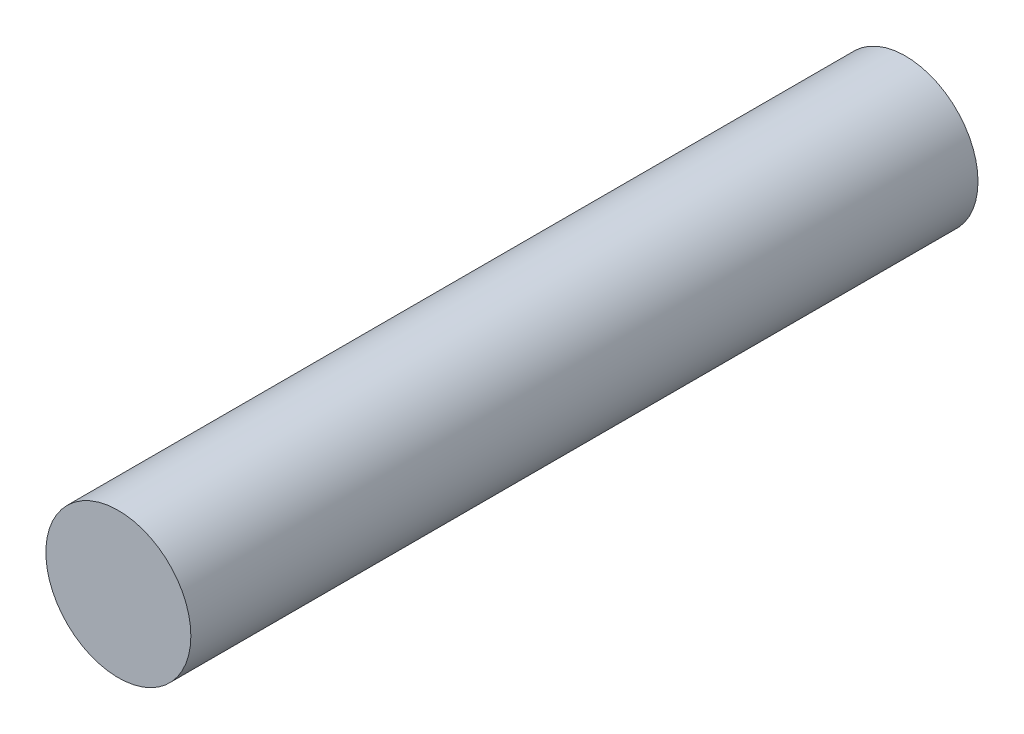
ISO-10303-21;
HEADER;
FILE_DESCRIPTION(('STEP AP214'),'2;1');
FILE_NAME('part.step','',(''),(''),'','','');
FILE_SCHEMA(('AUTOMOTIVE_DESIGN { 1 0 10303 214 1 1 1 1 }'));
ENDSEC;
DATA;
#1=APPLICATION_CONTEXT('core data for automotive mechanical design processes');
#2=APPLICATION_PROTOCOL_DEFINITION('international standard','automotive_design',2000,#1);
#3=PRODUCT_CONTEXT('',#1,'mechanical');
#4=PRODUCT('Part','Part','',(#3));
#5=PRODUCT_RELATED_PRODUCT_CATEGORY('part','',(#4));
#6=PRODUCT_DEFINITION_FORMATION('','',#4);
#7=PRODUCT_DEFINITION_CONTEXT('part definition',#1,'design');
#8=PRODUCT_DEFINITION('design','',#6,#7);
#9=PRODUCT_DEFINITION_SHAPE('','',#8);
#10=(LENGTH_UNIT() NAMED_UNIT(*) SI_UNIT(.MILLI.,.METRE.));
#11=(NAMED_UNIT(*) PLANE_ANGLE_UNIT() SI_UNIT($,.RADIAN.));
#12=(NAMED_UNIT(*) SI_UNIT($,.STERADIAN.) SOLID_ANGLE_UNIT());
#13=UNCERTAINTY_MEASURE_WITH_UNIT(LENGTH_MEASURE(1.E-05),#10,'distance_accuracy_value','');
#14=(GEOMETRIC_REPRESENTATION_CONTEXT(3) GLOBAL_UNCERTAINTY_ASSIGNED_CONTEXT((#13)) GLOBAL_UNIT_ASSIGNED_CONTEXT((#10,
#11,#12)) REPRESENTATION_CONTEXT('',''));
#15=CARTESIAN_POINT('',(0.,0.,0.));
#16=DIRECTION('',(0.,0.,1.));
#17=DIRECTION('',(1.,0.,0.));
#18=AXIS2_PLACEMENT_3D('',#15,#16,#17);
#19=CARTESIAN_POINT('',(0.,0.,38.));
#20=DIRECTION('',(0.,0.,-1.));
#21=DIRECTION('',(-1.,0.,0.));
#22=AXIS2_PLACEMENT_3D('',#19,#20,#21);
#23=PLANE('',#22);
#24=CARTESIAN_POINT('',(0.,0.,38.));
#25=DIRECTION('',(0.,0.,1.));
#26=DIRECTION('',(1.,0.,0.));
#27=AXIS2_PLACEMENT_3D('',#24,#25,#26);
#28=CIRCLE('',#27,3.5);
#29=CARTESIAN_POINT('',(3.5,0.,38.));
#30=VERTEX_POINT('',#29);
#31=EDGE_CURVE('E17',#30,#30,#28,.F.);
#32=ORIENTED_EDGE('',*,*,#31,.F.);
#33=EDGE_LOOP('',(#32));
#34=FACE_BOUND('',#33,.T.);
#35=ADVANCED_FACE('F14',(#34),#23,.F.);
#36=CARTESIAN_POINT('',(0.,0.,0.));
#37=DIRECTION('',(0.,0.,-1.));
#38=DIRECTION('',(-1.,0.,0.));
#39=AXIS2_PLACEMENT_3D('',#36,#37,#38);
#40=PLANE('',#39);
#41=CARTESIAN_POINT('',(0.,0.,0.));
#42=DIRECTION('',(0.,0.,1.));
#43=DIRECTION('',(1.,0.,0.));
#44=AXIS2_PLACEMENT_3D('',#41,#42,#43);
#45=CIRCLE('',#44,3.5);
#46=CARTESIAN_POINT('',(3.5,0.,0.));
#47=VERTEX_POINT('',#46);
#48=EDGE_CURVE('E10',#47,#47,#45,.T.);
#49=ORIENTED_EDGE('',*,*,#48,.F.);
#50=EDGE_LOOP('',(#49));
#51=FACE_BOUND('',#50,.T.);
#52=ADVANCED_FACE('F29',(#51),#40,.T.);
#53=CARTESIAN_POINT('',(0.,0.,0.));
#54=DIRECTION('',(0.,0.,1.));
#55=DIRECTION('',(1.,0.,0.));
#56=AXIS2_PLACEMENT_3D('',#53,#54,#55);
#57=CYLINDRICAL_SURFACE('',#56,3.5);
#58=ORIENTED_EDGE('',*,*,#48,.T.);
#59=EDGE_LOOP('',(#58));
#60=FACE_BOUND('',#59,.T.);
#61=ORIENTED_EDGE('',*,*,#31,.T.);
#62=EDGE_LOOP('',(#61));
#63=FACE_BOUND('',#62,.T.);
#64=ADVANCED_FACE('F26',(#60,#63),#57,.T.);
#65=CLOSED_SHELL('',(#35,#52,#64));
#66=MANIFOLD_SOLID_BREP('B1',#65);
#67=ADVANCED_BREP_SHAPE_REPRESENTATION('',(#18,#66),#14);
#68=SHAPE_DEFINITION_REPRESENTATION(#9,#67);
ENDSEC;
END-ISO-10303-21;
